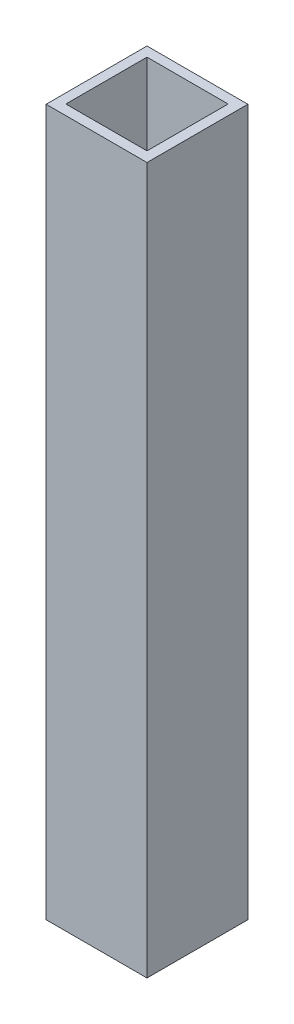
ISO-10303-21;
HEADER;
FILE_DESCRIPTION(('STEP AP214'),'2;1');
FILE_NAME('part.step','',(''),(''),'','','');
FILE_SCHEMA(('AUTOMOTIVE_DESIGN { 1 0 10303 214 1 1 1 1 }'));
ENDSEC;
DATA;
#1=APPLICATION_CONTEXT('core data for automotive mechanical design processes');
#2=APPLICATION_PROTOCOL_DEFINITION('international standard','automotive_design',2000,#1);
#3=PRODUCT_CONTEXT('',#1,'mechanical');
#4=PRODUCT('Part','Part','',(#3));
#5=PRODUCT_RELATED_PRODUCT_CATEGORY('part','',(#4));
#6=PRODUCT_DEFINITION_FORMATION('','',#4);
#7=PRODUCT_DEFINITION_CONTEXT('part definition',#1,'design');
#8=PRODUCT_DEFINITION('design','',#6,#7);
#9=PRODUCT_DEFINITION_SHAPE('','',#8);
#10=(LENGTH_UNIT() NAMED_UNIT(*) SI_UNIT(.MILLI.,.METRE.));
#11=(NAMED_UNIT(*) PLANE_ANGLE_UNIT() SI_UNIT($,.RADIAN.));
#12=(NAMED_UNIT(*) SI_UNIT($,.STERADIAN.) SOLID_ANGLE_UNIT());
#13=UNCERTAINTY_MEASURE_WITH_UNIT(LENGTH_MEASURE(1.E-05),#10,'distance_accuracy_value','');
#14=(GEOMETRIC_REPRESENTATION_CONTEXT(3) GLOBAL_UNCERTAINTY_ASSIGNED_CONTEXT((#13)) GLOBAL_UNIT_ASSIGNED_CONTEXT((#10,
#11,#12)) REPRESENTATION_CONTEXT('',''));
#15=CARTESIAN_POINT('',(0.,0.,0.));
#16=DIRECTION('',(0.,0.,1.));
#17=DIRECTION('',(1.,0.,0.));
#18=AXIS2_PLACEMENT_3D('',#15,#16,#17);
#19=CARTESIAN_POINT('',(0.,70.,0.));
#20=DIRECTION('',(0.,-1.,0.));
#21=DIRECTION('',(0.,0.,-1.));
#22=AXIS2_PLACEMENT_3D('',#19,#20,#21);
#23=PLANE('',#22);
#24=DIRECTION('',(0.,0.,-1.));
#25=VECTOR('',#24,1.);
#26=CARTESIAN_POINT('',(5.02136162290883,70.,5.02136162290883));
#27=LINE('',#26,#25);
#28=CARTESIAN_POINT('',(5.02136162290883,70.,5.02136162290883));
#29=VERTEX_POINT('',#28);
#30=CARTESIAN_POINT('',(5.02136162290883,70.,-4.97863837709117));
#31=VERTEX_POINT('',#30);
#32=EDGE_CURVE('E133',#29,#31,#27,.T.);
#33=ORIENTED_EDGE('',*,*,#32,.T.);
#34=DIRECTION('',(-1.,0.,0.));
#35=VECTOR('',#34,1.);
#36=CARTESIAN_POINT('',(-4.97863837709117,70.,-4.97863837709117));
#37=LINE('',#36,#35);
#38=CARTESIAN_POINT('',(-4.97863837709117,70.,-4.97863837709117));
#39=VERTEX_POINT('',#38);
#40=EDGE_CURVE('E136',#31,#39,#37,.T.);
#41=ORIENTED_EDGE('',*,*,#40,.T.);
#42=DIRECTION('',(0.,0.,1.));
#43=VECTOR('',#42,1.);
#44=CARTESIAN_POINT('',(-4.97863837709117,70.,5.02136162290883));
#45=LINE('',#44,#43);
#46=CARTESIAN_POINT('',(-4.97863837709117,70.,5.02136162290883));
#47=VERTEX_POINT('',#46);
#48=EDGE_CURVE('E139',#39,#47,#45,.T.);
#49=ORIENTED_EDGE('',*,*,#48,.T.);
#50=DIRECTION('',(1.,0.,0.));
#51=VECTOR('',#50,1.);
#52=CARTESIAN_POINT('',(-4.97863837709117,70.,5.02136162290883));
#53=LINE('',#52,#51);
#54=EDGE_CURVE('E141',#47,#29,#53,.T.);
#55=ORIENTED_EDGE('',*,*,#54,.T.);
#56=EDGE_LOOP('',(#33,#41,#49,#55));
#57=FACE_BOUND('',#56,.T.);
#58=DIRECTION('',(0.,0.,-1.));
#59=VECTOR('',#58,1.);
#60=CARTESIAN_POINT('',(4.02136162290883,70.,-4.02136162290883));
#61=LINE('',#60,#59);
#62=CARTESIAN_POINT('',(4.02136162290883,70.,4.02136162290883));
#63=VERTEX_POINT('',#62);
#64=CARTESIAN_POINT('',(4.02136162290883,70.,-4.02136162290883));
#65=VERTEX_POINT('',#64);
#66=EDGE_CURVE('E97',#63,#65,#61,.T.);
#67=ORIENTED_EDGE('',*,*,#66,.F.);
#68=DIRECTION('',(1.,0.,0.));
#69=VECTOR('',#68,1.);
#70=CARTESIAN_POINT('',(-4.02136162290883,70.,4.02136162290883));
#71=LINE('',#70,#69);
#72=CARTESIAN_POINT('',(-4.02136162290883,70.,4.02136162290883));
#73=VERTEX_POINT('',#72);
#74=EDGE_CURVE('E119',#73,#63,#71,.T.);
#75=ORIENTED_EDGE('',*,*,#74,.F.);
#76=DIRECTION('',(0.,0.,1.));
#77=VECTOR('',#76,1.);
#78=CARTESIAN_POINT('',(-4.02136162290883,70.,-4.02136162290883));
#79=LINE('',#78,#77);
#80=CARTESIAN_POINT('',(-4.02136162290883,70.,-4.02136162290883));
#81=VERTEX_POINT('',#80);
#82=EDGE_CURVE('E117',#81,#73,#79,.T.);
#83=ORIENTED_EDGE('',*,*,#82,.F.);
#84=DIRECTION('',(-1.,0.,0.));
#85=VECTOR('',#84,1.);
#86=CARTESIAN_POINT('',(-4.02136162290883,70.,-4.02136162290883));
#87=LINE('',#86,#85);
#88=EDGE_CURVE('E105',#65,#81,#87,.T.);
#89=ORIENTED_EDGE('',*,*,#88,.F.);
#90=EDGE_LOOP('',(#67,#75,#83,#89));
#91=FACE_BOUND('',#90,.T.);
#92=ADVANCED_FACE('F32',(#57,#91),#23,.F.);
#93=CARTESIAN_POINT('',(0.,0.,0.));
#94=DIRECTION('',(0.,-1.,0.));
#95=DIRECTION('',(0.,0.,-1.));
#96=AXIS2_PLACEMENT_3D('',#93,#94,#95);
#97=PLANE('',#96);
#98=DIRECTION('',(0.,0.,-1.));
#99=VECTOR('',#98,1.);
#100=CARTESIAN_POINT('',(5.02136162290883,0.,5.02136162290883));
#101=LINE('',#100,#99);
#102=CARTESIAN_POINT('',(5.02136162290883,0.,5.02136162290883));
#103=VERTEX_POINT('',#102);
#104=CARTESIAN_POINT('',(5.02136162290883,0.,-4.97863837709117));
#105=VERTEX_POINT('',#104);
#106=EDGE_CURVE('E113',#103,#105,#101,.T.);
#107=ORIENTED_EDGE('',*,*,#106,.F.);
#108=DIRECTION('',(1.,0.,0.));
#109=VECTOR('',#108,1.);
#110=CARTESIAN_POINT('',(-4.97863837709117,0.,5.02136162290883));
#111=LINE('',#110,#109);
#112=CARTESIAN_POINT('',(-4.97863837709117,0.,5.02136162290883));
#113=VERTEX_POINT('',#112);
#114=EDGE_CURVE('E137',#113,#103,#111,.T.);
#115=ORIENTED_EDGE('',*,*,#114,.F.);
#116=DIRECTION('',(0.,0.,1.));
#117=VECTOR('',#116,1.);
#118=CARTESIAN_POINT('',(-4.97863837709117,0.,5.02136162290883));
#119=LINE('',#118,#117);
#120=CARTESIAN_POINT('',(-4.97863837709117,0.,-4.97863837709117));
#121=VERTEX_POINT('',#120);
#122=EDGE_CURVE('E148',#121,#113,#119,.T.);
#123=ORIENTED_EDGE('',*,*,#122,.F.);
#124=DIRECTION('',(-1.,0.,0.));
#125=VECTOR('',#124,1.);
#126=CARTESIAN_POINT('',(-4.97863837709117,0.,-4.97863837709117));
#127=LINE('',#126,#125);
#128=EDGE_CURVE('E146',#105,#121,#127,.T.);
#129=ORIENTED_EDGE('',*,*,#128,.F.);
#130=EDGE_LOOP('',(#107,#115,#123,#129));
#131=FACE_BOUND('',#130,.T.);
#132=DIRECTION('',(1.,0.,0.));
#133=VECTOR('',#132,1.);
#134=CARTESIAN_POINT('',(-4.02136162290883,0.,4.02136162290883));
#135=LINE('',#134,#133);
#136=CARTESIAN_POINT('',(-4.02136162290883,0.,4.02136162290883));
#137=VERTEX_POINT('',#136);
#138=CARTESIAN_POINT('',(4.02136162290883,0.,4.02136162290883));
#139=VERTEX_POINT('',#138);
#140=EDGE_CURVE('E106',#137,#139,#135,.T.);
#141=ORIENTED_EDGE('',*,*,#140,.T.);
#142=DIRECTION('',(0.,0.,-1.));
#143=VECTOR('',#142,1.);
#144=CARTESIAN_POINT('',(4.02136162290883,0.,-4.02136162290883));
#145=LINE('',#144,#143);
#146=CARTESIAN_POINT('',(4.02136162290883,0.,-4.02136162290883));
#147=VERTEX_POINT('',#146);
#148=EDGE_CURVE('E55',#139,#147,#145,.T.);
#149=ORIENTED_EDGE('',*,*,#148,.T.);
#150=DIRECTION('',(-1.,0.,0.));
#151=VECTOR('',#150,1.);
#152=CARTESIAN_POINT('',(-4.02136162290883,0.,-4.02136162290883));
#153=LINE('',#152,#151);
#154=CARTESIAN_POINT('',(-4.02136162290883,0.,-4.02136162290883));
#155=VERTEX_POINT('',#154);
#156=EDGE_CURVE('E112',#147,#155,#153,.T.);
#157=ORIENTED_EDGE('',*,*,#156,.T.);
#158=DIRECTION('',(0.,0.,1.));
#159=VECTOR('',#158,1.);
#160=CARTESIAN_POINT('',(-4.02136162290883,0.,-4.02136162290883));
#161=LINE('',#160,#159);
#162=EDGE_CURVE('E125',#155,#137,#161,.T.);
#163=ORIENTED_EDGE('',*,*,#162,.T.);
#164=EDGE_LOOP('',(#141,#149,#157,#163));
#165=FACE_BOUND('',#164,.T.);
#166=ADVANCED_FACE('F166',(#131,#165),#97,.T.);
#167=CARTESIAN_POINT('',(5.02136162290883,70.,5.02136162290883));
#168=DIRECTION('',(-1.,0.,0.));
#169=DIRECTION('',(0.,0.,1.));
#170=AXIS2_PLACEMENT_3D('',#167,#168,#169);
#171=PLANE('',#170);
#172=ORIENTED_EDGE('',*,*,#106,.T.);
#173=DIRECTION('',(0.,-1.,0.));
#174=VECTOR('',#173,1.);
#175=CARTESIAN_POINT('',(5.02136162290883,70.,-4.97863837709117));
#176=LINE('',#175,#174);
#177=EDGE_CURVE('E11',#31,#105,#176,.T.);
#178=ORIENTED_EDGE('',*,*,#177,.F.);
#179=ORIENTED_EDGE('',*,*,#32,.F.);
#180=DIRECTION('',(0.,-1.,0.));
#181=VECTOR('',#180,1.);
#182=CARTESIAN_POINT('',(5.02136162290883,70.,5.02136162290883));
#183=LINE('',#182,#181);
#184=EDGE_CURVE('E143',#29,#103,#183,.T.);
#185=ORIENTED_EDGE('',*,*,#184,.T.);
#186=EDGE_LOOP('',(#172,#178,#179,#185));
#187=FACE_BOUND('',#186,.T.);
#188=ADVANCED_FACE('F34',(#187),#171,.F.);
#189=CARTESIAN_POINT('',(-4.97863837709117,70.,-4.97863837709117));
#190=DIRECTION('',(0.,0.,1.));
#191=DIRECTION('',(1.,0.,0.));
#192=AXIS2_PLACEMENT_3D('',#189,#190,#191);
#193=PLANE('',#192);
#194=ORIENTED_EDGE('',*,*,#128,.T.);
#195=DIRECTION('',(0.,-1.,0.));
#196=VECTOR('',#195,1.);
#197=CARTESIAN_POINT('',(-4.97863837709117,70.,-4.97863837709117));
#198=LINE('',#197,#196);
#199=EDGE_CURVE('E40',#39,#121,#198,.T.);
#200=ORIENTED_EDGE('',*,*,#199,.F.);
#201=ORIENTED_EDGE('',*,*,#40,.F.);
#202=ORIENTED_EDGE('',*,*,#177,.T.);
#203=EDGE_LOOP('',(#194,#200,#201,#202));
#204=FACE_BOUND('',#203,.T.);
#205=ADVANCED_FACE('F176',(#204),#193,.F.);
#206=CARTESIAN_POINT('',(-4.97863837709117,70.,5.02136162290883));
#207=DIRECTION('',(1.,0.,0.));
#208=DIRECTION('',(0.,0.,-1.));
#209=AXIS2_PLACEMENT_3D('',#206,#207,#208);
#210=PLANE('',#209);
#211=ORIENTED_EDGE('',*,*,#122,.T.);
#212=DIRECTION('',(0.,-1.,0.));
#213=VECTOR('',#212,1.);
#214=CARTESIAN_POINT('',(-4.97863837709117,70.,5.02136162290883));
#215=LINE('',#214,#213);
#216=EDGE_CURVE('E153',#47,#113,#215,.T.);
#217=ORIENTED_EDGE('',*,*,#216,.F.);
#218=ORIENTED_EDGE('',*,*,#48,.F.);
#219=ORIENTED_EDGE('',*,*,#199,.T.);
#220=EDGE_LOOP('',(#211,#217,#218,#219));
#221=FACE_BOUND('',#220,.T.);
#222=ADVANCED_FACE('F160',(#221),#210,.F.);
#223=CARTESIAN_POINT('',(-4.97863837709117,70.,5.02136162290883));
#224=DIRECTION('',(0.,0.,-1.));
#225=DIRECTION('',(-1.,0.,0.));
#226=AXIS2_PLACEMENT_3D('',#223,#224,#225);
#227=PLANE('',#226);
#228=ORIENTED_EDGE('',*,*,#114,.T.);
#229=ORIENTED_EDGE('',*,*,#184,.F.);
#230=ORIENTED_EDGE('',*,*,#54,.F.);
#231=ORIENTED_EDGE('',*,*,#216,.T.);
#232=EDGE_LOOP('',(#228,#229,#230,#231));
#233=FACE_BOUND('',#232,.T.);
#234=ADVANCED_FACE('F170',(#233),#227,.F.);
#235=CARTESIAN_POINT('',(4.02136162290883,70.,-4.02136162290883));
#236=DIRECTION('',(-1.,0.,0.));
#237=DIRECTION('',(0.,0.,1.));
#238=AXIS2_PLACEMENT_3D('',#235,#236,#237);
#239=PLANE('',#238);
#240=ORIENTED_EDGE('',*,*,#148,.F.);
#241=DIRECTION('',(0.,-1.,0.));
#242=VECTOR('',#241,1.);
#243=CARTESIAN_POINT('',(4.02136162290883,70.,4.02136162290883));
#244=LINE('',#243,#242);
#245=EDGE_CURVE('E101',#63,#139,#244,.T.);
#246=ORIENTED_EDGE('',*,*,#245,.F.);
#247=ORIENTED_EDGE('',*,*,#66,.T.);
#248=DIRECTION('',(0.,-1.,0.));
#249=VECTOR('',#248,1.);
#250=CARTESIAN_POINT('',(4.02136162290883,70.,-4.02136162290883));
#251=LINE('',#250,#249);
#252=EDGE_CURVE('E100',#65,#147,#251,.T.);
#253=ORIENTED_EDGE('',*,*,#252,.T.);
#254=EDGE_LOOP('',(#240,#246,#247,#253));
#255=FACE_BOUND('',#254,.T.);
#256=ADVANCED_FACE('F99',(#255),#239,.T.);
#257=CARTESIAN_POINT('',(-4.02136162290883,70.,-4.02136162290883));
#258=DIRECTION('',(0.,0.,1.));
#259=DIRECTION('',(1.,0.,0.));
#260=AXIS2_PLACEMENT_3D('',#257,#258,#259);
#261=PLANE('',#260);
#262=ORIENTED_EDGE('',*,*,#156,.F.);
#263=ORIENTED_EDGE('',*,*,#252,.F.);
#264=ORIENTED_EDGE('',*,*,#88,.T.);
#265=DIRECTION('',(0.,-1.,0.));
#266=VECTOR('',#265,1.);
#267=CARTESIAN_POINT('',(-4.02136162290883,70.,-4.02136162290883));
#268=LINE('',#267,#266);
#269=EDGE_CURVE('E114',#81,#155,#268,.T.);
#270=ORIENTED_EDGE('',*,*,#269,.T.);
#271=EDGE_LOOP('',(#262,#263,#264,#270));
#272=FACE_BOUND('',#271,.T.);
#273=ADVANCED_FACE('F109',(#272),#261,.T.);
#274=CARTESIAN_POINT('',(-4.02136162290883,70.,-4.02136162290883));
#275=DIRECTION('',(1.,0.,0.));
#276=DIRECTION('',(0.,0.,-1.));
#277=AXIS2_PLACEMENT_3D('',#274,#275,#276);
#278=PLANE('',#277);
#279=ORIENTED_EDGE('',*,*,#162,.F.);
#280=ORIENTED_EDGE('',*,*,#269,.F.);
#281=ORIENTED_EDGE('',*,*,#82,.T.);
#282=DIRECTION('',(0.,-1.,0.));
#283=VECTOR('',#282,1.);
#284=CARTESIAN_POINT('',(-4.02136162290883,70.,4.02136162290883));
#285=LINE('',#284,#283);
#286=EDGE_CURVE('E47',#73,#137,#285,.T.);
#287=ORIENTED_EDGE('',*,*,#286,.T.);
#288=EDGE_LOOP('',(#279,#280,#281,#287));
#289=FACE_BOUND('',#288,.T.);
#290=ADVANCED_FACE('F199',(#289),#278,.T.);
#291=CARTESIAN_POINT('',(-4.02136162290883,70.,4.02136162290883));
#292=DIRECTION('',(0.,0.,-1.));
#293=DIRECTION('',(-1.,0.,0.));
#294=AXIS2_PLACEMENT_3D('',#291,#292,#293);
#295=PLANE('',#294);
#296=ORIENTED_EDGE('',*,*,#140,.F.);
#297=ORIENTED_EDGE('',*,*,#286,.F.);
#298=ORIENTED_EDGE('',*,*,#74,.T.);
#299=ORIENTED_EDGE('',*,*,#245,.T.);
#300=EDGE_LOOP('',(#296,#297,#298,#299));
#301=FACE_BOUND('',#300,.T.);
#302=ADVANCED_FACE('F203',(#301),#295,.T.);
#303=CLOSED_SHELL('',(#92,#166,#188,#205,#222,#234,#256,#273,#290,#302));
#304=MANIFOLD_SOLID_BREP('B2',#303);
#305=ADVANCED_BREP_SHAPE_REPRESENTATION('',(#18,#304),#14);
#306=SHAPE_DEFINITION_REPRESENTATION(#9,#305);
ENDSEC;
END-ISO-10303-21;
